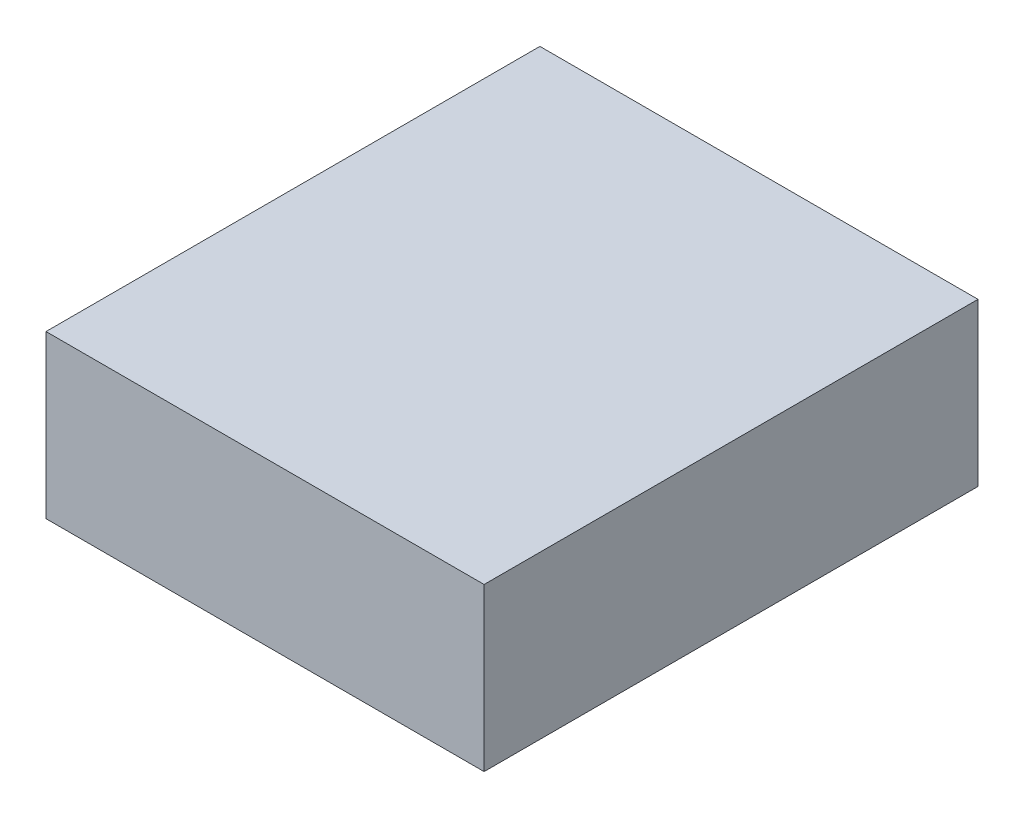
ISO-10303-21;
HEADER;
FILE_DESCRIPTION(('STEP AP214'),'2;1');
FILE_NAME('part.step','',(''),(''),'','','');
FILE_SCHEMA(('AUTOMOTIVE_DESIGN { 1 0 10303 214 1 1 1 1 }'));
ENDSEC;
DATA;
#1=APPLICATION_CONTEXT('core data for automotive mechanical design processes');
#2=APPLICATION_PROTOCOL_DEFINITION('international standard','automotive_design',2000,#1);
#3=PRODUCT_CONTEXT('',#1,'mechanical');
#4=PRODUCT('Part','Part','',(#3));
#5=PRODUCT_RELATED_PRODUCT_CATEGORY('part','',(#4));
#6=PRODUCT_DEFINITION_FORMATION('','',#4);
#7=PRODUCT_DEFINITION_CONTEXT('part definition',#1,'design');
#8=PRODUCT_DEFINITION('design','',#6,#7);
#9=PRODUCT_DEFINITION_SHAPE('','',#8);
#10=(LENGTH_UNIT() NAMED_UNIT(*) SI_UNIT(.MILLI.,.METRE.));
#11=(NAMED_UNIT(*) PLANE_ANGLE_UNIT() SI_UNIT($,.RADIAN.));
#12=(NAMED_UNIT(*) SI_UNIT($,.STERADIAN.) SOLID_ANGLE_UNIT());
#13=UNCERTAINTY_MEASURE_WITH_UNIT(LENGTH_MEASURE(1.E-05),#10,'distance_accuracy_value','');
#14=(GEOMETRIC_REPRESENTATION_CONTEXT(3) GLOBAL_UNCERTAINTY_ASSIGNED_CONTEXT((#13)) GLOBAL_UNIT_ASSIGNED_CONTEXT((#10,
#11,#12)) REPRESENTATION_CONTEXT('',''));
#15=CARTESIAN_POINT('',(0.,0.,0.));
#16=DIRECTION('',(0.,0.,1.));
#17=DIRECTION('',(1.,0.,0.));
#18=AXIS2_PLACEMENT_3D('',#15,#16,#17);
#19=CARTESIAN_POINT('',(-63.7084506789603,199.418809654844,-5.));
#20=DIRECTION('',(-1.,0.,0.));
#21=DIRECTION('',(0.,0.,1.));
#22=AXIS2_PLACEMENT_3D('',#19,#20,#21);
#23=PLANE('',#22);
#24=DIRECTION('',(0.,0.,1.));
#25=VECTOR('',#24,1.);
#26=CARTESIAN_POINT('',(-63.7084506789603,151.624033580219,-5.));
#27=LINE('',#26,#25);
#28=CARTESIAN_POINT('',(-63.7084506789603,151.624033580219,-5.));
#29=VERTEX_POINT('',#28);
#30=CARTESIAN_POINT('',(-63.7084506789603,151.624033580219,140.649714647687));
#31=VERTEX_POINT('',#30);
#32=EDGE_CURVE('E36',#29,#31,#27,.T.);
#33=ORIENTED_EDGE('',*,*,#32,.T.);
#34=DIRECTION('',(0.,-1.,0.));
#35=VECTOR('',#34,1.);
#36=CARTESIAN_POINT('',(-63.7084506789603,199.418809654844,140.649714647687));
#37=LINE('',#36,#35);
#38=CARTESIAN_POINT('',(-63.7084506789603,199.418809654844,140.649714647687));
#39=VERTEX_POINT('',#38);
#40=EDGE_CURVE('E73',#39,#31,#37,.T.);
#41=ORIENTED_EDGE('',*,*,#40,.F.);
#42=DIRECTION('',(0.,0.,1.));
#43=VECTOR('',#42,1.);
#44=CARTESIAN_POINT('',(-63.7084506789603,199.418809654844,-5.));
#45=LINE('',#44,#43);
#46=CARTESIAN_POINT('',(-63.7084506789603,199.418809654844,-5.));
#47=VERTEX_POINT('',#46);
#48=EDGE_CURVE('E11',#47,#39,#45,.T.);
#49=ORIENTED_EDGE('',*,*,#48,.F.);
#50=DIRECTION('',(0.,-1.,0.));
#51=VECTOR('',#50,1.);
#52=CARTESIAN_POINT('',(-63.7084506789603,199.418809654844,-5.));
#53=LINE('',#52,#51);
#54=EDGE_CURVE('E74',#47,#29,#53,.T.);
#55=ORIENTED_EDGE('',*,*,#54,.T.);
#56=EDGE_LOOP('',(#33,#41,#49,#55));
#57=FACE_BOUND('',#56,.T.);
#58=ADVANCED_FACE('F33',(#57),#23,.T.);
#59=CARTESIAN_POINT('',(-63.7084506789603,199.418809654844,-5.));
#60=DIRECTION('',(0.,1.,0.));
#61=DIRECTION('',(0.,0.,1.));
#62=AXIS2_PLACEMENT_3D('',#59,#60,#61);
#63=PLANE('',#62);
#64=ORIENTED_EDGE('',*,*,#48,.T.);
#65=DIRECTION('',(-1.,0.,0.));
#66=VECTOR('',#65,1.);
#67=CARTESIAN_POINT('',(-63.7084506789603,199.418809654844,140.649714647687));
#68=LINE('',#67,#66);
#69=CARTESIAN_POINT('',(65.4879132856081,199.418809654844,140.649714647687));
#70=VERTEX_POINT('',#69);
#71=EDGE_CURVE('E90',#70,#39,#68,.T.);
#72=ORIENTED_EDGE('',*,*,#71,.F.);
#73=DIRECTION('',(0.,0.,1.));
#74=VECTOR('',#73,1.);
#75=CARTESIAN_POINT('',(65.4879132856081,199.418809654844,-5.));
#76=LINE('',#75,#74);
#77=CARTESIAN_POINT('',(65.4879132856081,199.418809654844,-5.));
#78=VERTEX_POINT('',#77);
#79=EDGE_CURVE('E41',#78,#70,#76,.T.);
#80=ORIENTED_EDGE('',*,*,#79,.F.);
#81=DIRECTION('',(-1.,0.,0.));
#82=VECTOR('',#81,1.);
#83=CARTESIAN_POINT('',(-63.7084506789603,199.418809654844,-5.));
#84=LINE('',#83,#82);
#85=EDGE_CURVE('E79',#78,#47,#84,.T.);
#86=ORIENTED_EDGE('',*,*,#85,.T.);
#87=EDGE_LOOP('',(#64,#72,#80,#86));
#88=FACE_BOUND('',#87,.T.);
#89=ADVANCED_FACE('F105',(#88),#63,.T.);
#90=CARTESIAN_POINT('',(65.4879132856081,199.418809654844,-5.));
#91=DIRECTION('',(1.,0.,0.));
#92=DIRECTION('',(0.,0.,-1.));
#93=AXIS2_PLACEMENT_3D('',#90,#91,#92);
#94=PLANE('',#93);
#95=ORIENTED_EDGE('',*,*,#79,.T.);
#96=DIRECTION('',(0.,1.,0.));
#97=VECTOR('',#96,1.);
#98=CARTESIAN_POINT('',(65.4879132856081,199.418809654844,140.649714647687));
#99=LINE('',#98,#97);
#100=CARTESIAN_POINT('',(65.4879132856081,151.624033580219,140.649714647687));
#101=VERTEX_POINT('',#100);
#102=EDGE_CURVE('E86',#101,#70,#99,.T.);
#103=ORIENTED_EDGE('',*,*,#102,.F.);
#104=DIRECTION('',(0.,0.,1.));
#105=VECTOR('',#104,1.);
#106=CARTESIAN_POINT('',(65.4879132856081,151.624033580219,-5.));
#107=LINE('',#106,#105);
#108=CARTESIAN_POINT('',(65.4879132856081,151.624033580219,-5.));
#109=VERTEX_POINT('',#108);
#110=EDGE_CURVE('E78',#109,#101,#107,.T.);
#111=ORIENTED_EDGE('',*,*,#110,.F.);
#112=DIRECTION('',(0.,1.,0.));
#113=VECTOR('',#112,1.);
#114=CARTESIAN_POINT('',(65.4879132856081,199.418809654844,-5.));
#115=LINE('',#114,#113);
#116=EDGE_CURVE('E98',#109,#78,#115,.T.);
#117=ORIENTED_EDGE('',*,*,#116,.T.);
#118=EDGE_LOOP('',(#95,#103,#111,#117));
#119=FACE_BOUND('',#118,.T.);
#120=ADVANCED_FACE('F102',(#119),#94,.T.);
#121=CARTESIAN_POINT('',(-63.7084506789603,151.624033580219,-5.));
#122=DIRECTION('',(0.,-1.,0.));
#123=DIRECTION('',(0.,0.,-1.));
#124=AXIS2_PLACEMENT_3D('',#121,#122,#123);
#125=PLANE('',#124);
#126=ORIENTED_EDGE('',*,*,#110,.T.);
#127=DIRECTION('',(1.,0.,0.));
#128=VECTOR('',#127,1.);
#129=CARTESIAN_POINT('',(-63.7084506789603,151.624033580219,140.649714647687));
#130=LINE('',#129,#128);
#131=EDGE_CURVE('E81',#31,#101,#130,.T.);
#132=ORIENTED_EDGE('',*,*,#131,.F.);
#133=ORIENTED_EDGE('',*,*,#32,.F.);
#134=DIRECTION('',(1.,0.,0.));
#135=VECTOR('',#134,1.);
#136=CARTESIAN_POINT('',(-63.7084506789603,151.624033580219,-5.));
#137=LINE('',#136,#135);
#138=EDGE_CURVE('E96',#29,#109,#137,.T.);
#139=ORIENTED_EDGE('',*,*,#138,.T.);
#140=EDGE_LOOP('',(#126,#132,#133,#139));
#141=FACE_BOUND('',#140,.T.);
#142=ADVANCED_FACE('F82',(#141),#125,.T.);
#143=CARTESIAN_POINT('',(0.,0.,-5.));
#144=DIRECTION('',(0.,0.,1.));
#145=DIRECTION('',(1.,0.,0.));
#146=AXIS2_PLACEMENT_3D('',#143,#144,#145);
#147=PLANE('',#146);
#148=ORIENTED_EDGE('',*,*,#54,.F.);
#149=ORIENTED_EDGE('',*,*,#85,.F.);
#150=ORIENTED_EDGE('',*,*,#116,.F.);
#151=ORIENTED_EDGE('',*,*,#138,.F.);
#152=EDGE_LOOP('',(#148,#149,#150,#151));
#153=FACE_BOUND('',#152,.T.);
#154=ADVANCED_FACE('F107',(#153),#147,.F.);
#155=CARTESIAN_POINT('',(0.,0.,140.649714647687));
#156=DIRECTION('',(0.,0.,1.));
#157=DIRECTION('',(1.,0.,0.));
#158=AXIS2_PLACEMENT_3D('',#155,#156,#157);
#159=PLANE('',#158);
#160=ORIENTED_EDGE('',*,*,#40,.T.);
#161=ORIENTED_EDGE('',*,*,#131,.T.);
#162=ORIENTED_EDGE('',*,*,#102,.T.);
#163=ORIENTED_EDGE('',*,*,#71,.T.);
#164=EDGE_LOOP('',(#160,#161,#162,#163));
#165=FACE_BOUND('',#164,.T.);
#166=ADVANCED_FACE('F89',(#165),#159,.T.);
#167=CLOSED_SHELL('',(#58,#89,#120,#142,#154,#166));
#168=MANIFOLD_SOLID_BREP('B2',#167);
#169=ADVANCED_BREP_SHAPE_REPRESENTATION('',(#18,#168),#14);
#170=SHAPE_DEFINITION_REPRESENTATION(#9,#169);
ENDSEC;
END-ISO-10303-21;
